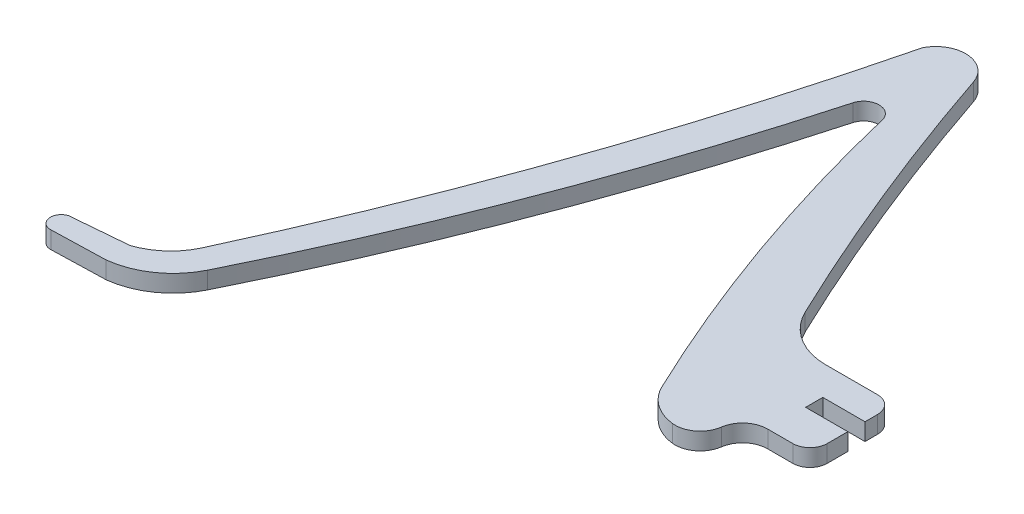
ISO-10303-21;
HEADER;
FILE_DESCRIPTION(('STEP AP214'),'2;1');
FILE_NAME('part.step','',(''),(''),'','','');
FILE_SCHEMA(('AUTOMOTIVE_DESIGN { 1 0 10303 214 1 1 1 1 }'));
ENDSEC;
DATA;
#1=APPLICATION_CONTEXT('core data for automotive mechanical design processes');
#2=APPLICATION_PROTOCOL_DEFINITION('international standard','automotive_design',2000,#1);
#3=PRODUCT_CONTEXT('',#1,'mechanical');
#4=PRODUCT('Part','Part','',(#3));
#5=PRODUCT_RELATED_PRODUCT_CATEGORY('part','',(#4));
#6=PRODUCT_DEFINITION_FORMATION('','',#4);
#7=PRODUCT_DEFINITION_CONTEXT('part definition',#1,'design');
#8=PRODUCT_DEFINITION('design','',#6,#7);
#9=PRODUCT_DEFINITION_SHAPE('','',#8);
#10=(LENGTH_UNIT() NAMED_UNIT(*) SI_UNIT(.MILLI.,.METRE.));
#11=(NAMED_UNIT(*) PLANE_ANGLE_UNIT() SI_UNIT($,.RADIAN.));
#12=(NAMED_UNIT(*) SI_UNIT($,.STERADIAN.) SOLID_ANGLE_UNIT());
#13=UNCERTAINTY_MEASURE_WITH_UNIT(LENGTH_MEASURE(1.E-05),#10,'distance_accuracy_value','');
#14=(GEOMETRIC_REPRESENTATION_CONTEXT(3) GLOBAL_UNCERTAINTY_ASSIGNED_CONTEXT((#13)) GLOBAL_UNIT_ASSIGNED_CONTEXT((#10,
#11,#12)) REPRESENTATION_CONTEXT('',''));
#15=CARTESIAN_POINT('',(0.,0.,0.));
#16=DIRECTION('',(0.,0.,1.));
#17=DIRECTION('',(1.,0.,0.));
#18=AXIS2_PLACEMENT_3D('',#15,#16,#17);
#19=CARTESIAN_POINT('',(-41735.6171870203,3.,-18306.9316403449));
#20=DIRECTION('',(0.,-1.,0.));
#21=DIRECTION('',(0.,0.,-1.));
#22=AXIS2_PLACEMENT_3D('',#19,#20,#21);
#23=CYLINDRICAL_SURFACE('',#22,1.87725100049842);
#24=CARTESIAN_POINT('',(-41735.6171870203,0.,-18306.9316403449));
#25=DIRECTION('',(0.,1.,0.));
#26=DIRECTION('',(0.,0.,1.));
#27=AXIS2_PLACEMENT_3D('',#24,#25,#26);
#28=CIRCLE('',#27,1.87725100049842);
#29=CARTESIAN_POINT('',(-41735.449746,0.,-18308.801409));
#30=VERTEX_POINT('',#29);
#31=CARTESIAN_POINT('',(-41735.564459,0.,-18305.0551299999));
#32=VERTEX_POINT('',#31);
#33=EDGE_CURVE('E228',#30,#32,#28,.T.);
#34=ORIENTED_EDGE('',*,*,#33,.T.);
#35=DIRECTION('',(0.,-1.,0.));
#36=VECTOR('',#35,1.);
#37=CARTESIAN_POINT('',(-41735.564459,3.,-18305.0551299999));
#38=LINE('',#37,#36);
#39=CARTESIAN_POINT('',(-41735.564459,3.,-18305.0551299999));
#40=VERTEX_POINT('',#39);
#41=EDGE_CURVE('E11',#40,#32,#38,.T.);
#42=ORIENTED_EDGE('',*,*,#41,.F.);
#43=CARTESIAN_POINT('',(-41735.6171870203,3.,-18306.9316403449));
#44=DIRECTION('',(0.,1.,0.));
#45=DIRECTION('',(0.,0.,1.));
#46=AXIS2_PLACEMENT_3D('',#43,#44,#45);
#47=CIRCLE('',#46,1.87725100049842);
#48=CARTESIAN_POINT('',(-41735.449746,3.,-18308.801409));
#49=VERTEX_POINT('',#48);
#50=EDGE_CURVE('E274',#49,#40,#47,.T.);
#51=ORIENTED_EDGE('',*,*,#50,.F.);
#52=DIRECTION('',(0.,-1.,0.));
#53=VECTOR('',#52,1.);
#54=CARTESIAN_POINT('',(-41735.449746,3.,-18308.801409));
#55=LINE('',#54,#53);
#56=EDGE_CURVE('E224',#49,#30,#55,.T.);
#57=ORIENTED_EDGE('',*,*,#56,.T.);
#58=EDGE_LOOP('',(#34,#42,#51,#57));
#59=FACE_BOUND('',#58,.T.);
#60=ADVANCED_FACE('F36',(#59),#23,.T.);
#61=CARTESIAN_POINT('',(-41735.564459,3.,-18305.0551299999));
#62=DIRECTION('',(-0.0283589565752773,0.,-0.999597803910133));
#63=DIRECTION('',(-0.999597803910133,0.,0.0283589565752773));
#64=AXIS2_PLACEMENT_3D('',#61,#62,#63);
#65=PLANE('',#64);
#66=DIRECTION('',(0.999597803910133,0.,-0.0283589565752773));
#67=VECTOR('',#66,1.);
#68=CARTESIAN_POINT('',(-41735.564459,0.,-18305.0551299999));
#69=LINE('',#68,#67);
#70=CARTESIAN_POINT('',(-41726.148437,0.,-18305.322266));
#71=VERTEX_POINT('',#70);
#72=EDGE_CURVE('E231',#32,#71,#69,.T.);
#73=ORIENTED_EDGE('',*,*,#72,.T.);
#74=DIRECTION('',(0.,-1.,0.));
#75=VECTOR('',#74,1.);
#76=CARTESIAN_POINT('',(-41726.148437,3.,-18305.322266));
#77=LINE('',#76,#75);
#78=CARTESIAN_POINT('',(-41726.148437,3.,-18305.322266));
#79=VERTEX_POINT('',#78);
#80=EDGE_CURVE('E44',#79,#71,#77,.T.);
#81=ORIENTED_EDGE('',*,*,#80,.F.);
#82=DIRECTION('',(0.999597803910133,0.,-0.0283589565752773));
#83=VECTOR('',#82,1.);
#84=CARTESIAN_POINT('',(-41735.564459,3.,-18305.0551299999));
#85=LINE('',#84,#83);
#86=EDGE_CURVE('E143',#40,#79,#85,.T.);
#87=ORIENTED_EDGE('',*,*,#86,.F.);
#88=ORIENTED_EDGE('',*,*,#41,.T.);
#89=EDGE_LOOP('',(#73,#81,#87,#88));
#90=FACE_BOUND('',#89,.T.);
#91=ADVANCED_FACE('F412',(#90),#65,.F.);
#92=CARTESIAN_POINT('',(-41727.6904464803,3.,-18318.5260678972));
#93=DIRECTION('',(0.,-1.,0.));
#94=DIRECTION('',(0.,0.,-1.));
#95=AXIS2_PLACEMENT_3D('',#92,#93,#94);
#96=CYLINDRICAL_SURFACE('',#95,13.2935389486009);
#97=CARTESIAN_POINT('',(-41727.6904464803,0.,-18318.5260678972));
#98=DIRECTION('',(0.,1.,0.));
#99=DIRECTION('',(0.,0.,1.));
#100=AXIS2_PLACEMENT_3D('',#97,#98,#99);
#101=CIRCLE('',#100,13.2935389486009);
#102=CARTESIAN_POINT('',(-41715.768727,0.,-18312.644675));
#103=VERTEX_POINT('',#102);
#104=EDGE_CURVE('E233',#71,#103,#101,.T.);
#105=ORIENTED_EDGE('',*,*,#104,.T.);
#106=DIRECTION('',(0.,-1.,0.));
#107=VECTOR('',#106,1.);
#108=CARTESIAN_POINT('',(-41715.768727,3.,-18312.644675));
#109=LINE('',#108,#107);
#110=CARTESIAN_POINT('',(-41715.768727,3.,-18312.644675));
#111=VERTEX_POINT('',#110);
#112=EDGE_CURVE('E329',#111,#103,#109,.T.);
#113=ORIENTED_EDGE('',*,*,#112,.F.);
#114=CARTESIAN_POINT('',(-41727.6904464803,3.,-18318.5260678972));
#115=DIRECTION('',(0.,1.,0.));
#116=DIRECTION('',(0.,0.,1.));
#117=AXIS2_PLACEMENT_3D('',#114,#115,#116);
#118=CIRCLE('',#117,13.2935389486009);
#119=EDGE_CURVE('E337',#79,#111,#118,.T.);
#120=ORIENTED_EDGE('',*,*,#119,.F.);
#121=ORIENTED_EDGE('',*,*,#80,.T.);
#122=EDGE_LOOP('',(#105,#113,#120,#121));
#123=FACE_BOUND('',#122,.T.);
#124=ADVANCED_FACE('F335',(#123),#96,.T.);
#125=CARTESIAN_POINT('',(-42128.664315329,3.,-18516.2507745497));
#126=DIRECTION('',(0.,-1.,0.));
#127=DIRECTION('',(0.,0.,-1.));
#128=AXIS2_PLACEMENT_3D('',#125,#126,#127);
#129=CYLINDRICAL_SURFACE('',#128,460.367473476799);
#130=CARTESIAN_POINT('',(-42128.664315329,0.,-18516.2507745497));
#131=DIRECTION('',(0.,1.,0.));
#132=DIRECTION('',(0.,0.,1.));
#133=AXIS2_PLACEMENT_3D('',#130,#131,#132);
#134=CIRCLE('',#133,460.367473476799);
#135=CARTESIAN_POINT('',(-41684.7597910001,0.,-18394.2385459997));
#136=VERTEX_POINT('',#135);
#137=EDGE_CURVE('E235',#103,#136,#134,.T.);
#138=ORIENTED_EDGE('',*,*,#137,.T.);
#139=DIRECTION('',(0.,-1.,0.));
#140=VECTOR('',#139,1.);
#141=CARTESIAN_POINT('',(-41684.7597910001,3.,-18394.2385459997));
#142=LINE('',#141,#140);
#143=CARTESIAN_POINT('',(-41684.7597910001,3.,-18394.2385459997));
#144=VERTEX_POINT('',#143);
#145=EDGE_CURVE('E326',#144,#136,#142,.T.);
#146=ORIENTED_EDGE('',*,*,#145,.F.);
#147=CARTESIAN_POINT('',(-42128.664315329,3.,-18516.2507745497));
#148=DIRECTION('',(0.,1.,0.));
#149=DIRECTION('',(0.,0.,1.));
#150=AXIS2_PLACEMENT_3D('',#147,#148,#149);
#151=CIRCLE('',#150,460.367473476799);
#152=EDGE_CURVE('E355',#111,#144,#151,.T.);
#153=ORIENTED_EDGE('',*,*,#152,.F.);
#154=ORIENTED_EDGE('',*,*,#112,.T.);
#155=EDGE_LOOP('',(#138,#146,#153,#154));
#156=FACE_BOUND('',#155,.T.);
#157=ADVANCED_FACE('F346',(#156),#129,.T.);
#158=CARTESIAN_POINT('',(-41682.1651776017,3.,-18393.5253188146));
#159=DIRECTION('',(0.,-1.,0.));
#160=DIRECTION('',(0.,0.,-1.));
#161=AXIS2_PLACEMENT_3D('',#158,#159,#160);
#162=CYLINDRICAL_SURFACE('',#161,2.69085705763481);
#163=CARTESIAN_POINT('',(-41682.1651776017,0.,-18393.5253188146));
#164=DIRECTION('',(0.,-1.,0.));
#165=DIRECTION('',(0.,0.,1.));
#166=AXIS2_PLACEMENT_3D('',#163,#164,#165);
#167=CIRCLE('',#166,2.69085705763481);
#168=CARTESIAN_POINT('',(-41679.684114,0.,-18394.566969));
#169=VERTEX_POINT('',#168);
#170=EDGE_CURVE('E237',#136,#169,#167,.T.);
#171=ORIENTED_EDGE('',*,*,#170,.T.);
#172=DIRECTION('',(0.,-1.,0.));
#173=VECTOR('',#172,1.);
#174=CARTESIAN_POINT('',(-41679.684114,3.,-18394.566969));
#175=LINE('',#174,#173);
#176=CARTESIAN_POINT('',(-41679.684114,3.,-18394.566969));
#177=VERTEX_POINT('',#176);
#178=EDGE_CURVE('E323',#177,#169,#175,.T.);
#179=ORIENTED_EDGE('',*,*,#178,.F.);
#180=CARTESIAN_POINT('',(-41682.1651776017,3.,-18393.5253188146));
#181=DIRECTION('',(0.,-1.,0.));
#182=DIRECTION('',(0.,0.,1.));
#183=AXIS2_PLACEMENT_3D('',#180,#181,#182);
#184=CIRCLE('',#183,2.69085705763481);
#185=EDGE_CURVE('E352',#144,#177,#184,.T.);
#186=ORIENTED_EDGE('',*,*,#185,.F.);
#187=ORIENTED_EDGE('',*,*,#145,.T.);
#188=EDGE_LOOP('',(#171,#179,#186,#187));
#189=FACE_BOUND('',#188,.T.);
#190=ADVANCED_FACE('F350',(#189),#162,.F.);
#191=CARTESIAN_POINT('',(-41387.5661853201,3.,-18464.1934135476));
#192=DIRECTION('',(0.,-1.,0.));
#193=DIRECTION('',(0.,0.,-1.));
#194=AXIS2_PLACEMENT_3D('',#191,#192,#193);
#195=CYLINDRICAL_SURFACE('',#194,300.3010590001);
#196=CARTESIAN_POINT('',(-41387.5661853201,0.,-18464.1934135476));
#197=DIRECTION('',(0.,1.,0.));
#198=DIRECTION('',(0.,0.,1.));
#199=AXIS2_PLACEMENT_3D('',#196,#197,#198);
#200=CIRCLE('',#199,300.3010590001);
#201=CARTESIAN_POINT('',(-41658.479214,0.,-18334.6293100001));
#202=VERTEX_POINT('',#201);
#203=EDGE_CURVE('E239',#169,#202,#200,.T.);
#204=ORIENTED_EDGE('',*,*,#203,.T.);
#205=DIRECTION('',(0.,-1.,0.));
#206=VECTOR('',#205,1.);
#207=CARTESIAN_POINT('',(-41658.479214,3.,-18334.6293100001));
#208=LINE('',#207,#206);
#209=CARTESIAN_POINT('',(-41658.479214,3.,-18334.6293100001));
#210=VERTEX_POINT('',#209);
#211=EDGE_CURVE('E320',#210,#202,#208,.T.);
#212=ORIENTED_EDGE('',*,*,#211,.F.);
#213=CARTESIAN_POINT('',(-41387.5661853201,3.,-18464.1934135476));
#214=DIRECTION('',(0.,1.,0.));
#215=DIRECTION('',(0.,0.,1.));
#216=AXIS2_PLACEMENT_3D('',#213,#214,#215);
#217=CIRCLE('',#216,300.3010590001);
#218=EDGE_CURVE('E354',#177,#210,#217,.T.);
#219=ORIENTED_EDGE('',*,*,#218,.F.);
#220=ORIENTED_EDGE('',*,*,#178,.T.);
#221=EDGE_LOOP('',(#204,#212,#219,#220));
#222=FACE_BOUND('',#221,.T.);
#223=ADVANCED_FACE('F425',(#222),#195,.T.);
#224=CARTESIAN_POINT('',(-41651.0954421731,3.,-18338.1613657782));
#225=DIRECTION('',(0.,-1.,0.));
#226=DIRECTION('',(0.,0.,-1.));
#227=AXIS2_PLACEMENT_3D('',#224,#225,#226);
#228=CYLINDRICAL_SURFACE('',#227,8.18507815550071);
#229=CARTESIAN_POINT('',(-41651.0954421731,0.,-18338.1613657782));
#230=DIRECTION('',(0.,1.,0.));
#231=DIRECTION('',(0.,0.,1.));
#232=AXIS2_PLACEMENT_3D('',#229,#230,#231);
#233=CIRCLE('',#232,8.18507815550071);
#234=CARTESIAN_POINT('',(-41652.048728,0.,-18330.03199));
#235=VERTEX_POINT('',#234);
#236=EDGE_CURVE('E241',#202,#235,#233,.T.);
#237=ORIENTED_EDGE('',*,*,#236,.T.);
#238=DIRECTION('',(0.,-1.,0.));
#239=VECTOR('',#238,1.);
#240=CARTESIAN_POINT('',(-41652.048728,3.,-18330.03199));
#241=LINE('',#240,#239);
#242=CARTESIAN_POINT('',(-41652.048728,3.,-18330.03199));
#243=VERTEX_POINT('',#242);
#244=EDGE_CURVE('E317',#243,#235,#241,.T.);
#245=ORIENTED_EDGE('',*,*,#244,.F.);
#246=CARTESIAN_POINT('',(-41651.0954421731,3.,-18338.1613657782));
#247=DIRECTION('',(0.,1.,0.));
#248=DIRECTION('',(0.,0.,1.));
#249=AXIS2_PLACEMENT_3D('',#246,#247,#248);
#250=CIRCLE('',#249,8.18507815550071);
#251=EDGE_CURVE('E357',#210,#243,#250,.T.);
#252=ORIENTED_EDGE('',*,*,#251,.F.);
#253=ORIENTED_EDGE('',*,*,#211,.T.);
#254=EDGE_LOOP('',(#237,#245,#252,#253));
#255=FACE_BOUND('',#254,.T.);
#256=ADVANCED_FACE('F428',(#255),#228,.T.);
#257=CARTESIAN_POINT('',(-41651.5397496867,3.,-18334.3725173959));
#258=DIRECTION('',(0.,-1.,0.));
#259=DIRECTION('',(0.,0.,-1.));
#260=AXIS2_PLACEMENT_3D('',#257,#258,#259);
#261=CYLINDRICAL_SURFACE('',#260,4.37026738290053);
#262=CARTESIAN_POINT('',(-41651.5397496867,0.,-18334.3725173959));
#263=DIRECTION('',(0.,1.,0.));
#264=DIRECTION('',(0.,0.,1.));
#265=AXIS2_PLACEMENT_3D('',#262,#263,#264);
#266=CIRCLE('',#265,4.37026738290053);
#267=CARTESIAN_POINT('',(-41647.213194,0.,-18333.755952));
#268=VERTEX_POINT('',#267);
#269=EDGE_CURVE('E243',#235,#268,#266,.T.);
#270=ORIENTED_EDGE('',*,*,#269,.T.);
#271=DIRECTION('',(0.,-1.,0.));
#272=VECTOR('',#271,1.);
#273=CARTESIAN_POINT('',(-41647.213194,3.,-18333.755952));
#274=LINE('',#273,#272);
#275=CARTESIAN_POINT('',(-41647.213194,3.,-18333.755952));
#276=VERTEX_POINT('',#275);
#277=EDGE_CURVE('E314',#276,#268,#274,.T.);
#278=ORIENTED_EDGE('',*,*,#277,.F.);
#279=CARTESIAN_POINT('',(-41651.5397496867,3.,-18334.3725173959));
#280=DIRECTION('',(0.,1.,0.));
#281=DIRECTION('',(0.,0.,1.));
#282=AXIS2_PLACEMENT_3D('',#279,#280,#281);
#283=CIRCLE('',#282,4.37026738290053);
#284=EDGE_CURVE('E363',#243,#276,#283,.T.);
#285=ORIENTED_EDGE('',*,*,#284,.F.);
#286=ORIENTED_EDGE('',*,*,#244,.T.);
#287=EDGE_LOOP('',(#270,#278,#285,#286));
#288=FACE_BOUND('',#287,.T.);
#289=ADVANCED_FACE('F432',(#288),#261,.T.);
#290=CARTESIAN_POINT('',(-41642.9001352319,3.,-18333.1391655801));
#291=DIRECTION('',(0.,-1.,0.));
#292=DIRECTION('',(0.,0.,-1.));
#293=AXIS2_PLACEMENT_3D('',#290,#291,#292);
#294=CYLINDRICAL_SURFACE('',#293,4.35693716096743);
#295=CARTESIAN_POINT('',(-41642.9001352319,0.,-18333.1391655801));
#296=DIRECTION('',(0.,-1.,0.));
#297=DIRECTION('',(0.,0.,1.));
#298=AXIS2_PLACEMENT_3D('',#295,#296,#297);
#299=CIRCLE('',#298,4.35693716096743);
#300=CARTESIAN_POINT('',(-41642.8612260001,0.,-18337.495929));
#301=VERTEX_POINT('',#300);
#302=EDGE_CURVE('E245',#268,#301,#299,.T.);
#303=ORIENTED_EDGE('',*,*,#302,.T.);
#304=DIRECTION('',(0.,-1.,0.));
#305=VECTOR('',#304,1.);
#306=CARTESIAN_POINT('',(-41642.8612260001,3.,-18337.495929));
#307=LINE('',#306,#305);
#308=CARTESIAN_POINT('',(-41642.8612260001,3.,-18337.495929));
#309=VERTEX_POINT('',#308);
#310=EDGE_CURVE('E311',#309,#301,#307,.T.);
#311=ORIENTED_EDGE('',*,*,#310,.F.);
#312=CARTESIAN_POINT('',(-41642.9001352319,3.,-18333.1391655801));
#313=DIRECTION('',(0.,-1.,0.));
#314=DIRECTION('',(0.,0.,1.));
#315=AXIS2_PLACEMENT_3D('',#312,#313,#314);
#316=CIRCLE('',#315,4.35693716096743);
#317=EDGE_CURVE('E365',#276,#309,#316,.T.);
#318=ORIENTED_EDGE('',*,*,#317,.F.);
#319=ORIENTED_EDGE('',*,*,#277,.T.);
#320=EDGE_LOOP('',(#303,#311,#318,#319));
#321=FACE_BOUND('',#320,.T.);
#322=ADVANCED_FACE('F436',(#321),#294,.F.);
#323=CARTESIAN_POINT('',(-41642.8612260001,3.,-18337.495929));
#324=DIRECTION('',(-3.7732018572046E-05,0.,-0.999999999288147));
#325=DIRECTION('',(-0.999999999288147,0.,3.7732018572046E-05));
#326=AXIS2_PLACEMENT_3D('',#323,#324,#325);
#327=PLANE('',#326);
#328=DIRECTION('',(0.999999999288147,0.,-3.7732018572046E-05));
#329=VECTOR('',#328,1.);
#330=CARTESIAN_POINT('',(-41642.8612260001,0.,-18337.495929));
#331=LINE('',#330,#329);
#332=CARTESIAN_POINT('',(-41638.488281,0.,-18337.496094));
#333=VERTEX_POINT('',#332);
#334=EDGE_CURVE('E247',#301,#333,#331,.T.);
#335=ORIENTED_EDGE('',*,*,#334,.T.);
#336=DIRECTION('',(0.,-1.,0.));
#337=VECTOR('',#336,1.);
#338=CARTESIAN_POINT('',(-41638.488281,3.,-18337.496094));
#339=LINE('',#338,#337);
#340=CARTESIAN_POINT('',(-41638.488281,3.,-18337.496094));
#341=VERTEX_POINT('',#340);
#342=EDGE_CURVE('E308',#341,#333,#339,.T.);
#343=ORIENTED_EDGE('',*,*,#342,.F.);
#344=DIRECTION('',(0.999999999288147,0.,-3.7732018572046E-05));
#345=VECTOR('',#344,1.);
#346=CARTESIAN_POINT('',(-41642.8612260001,3.,-18337.495929));
#347=LINE('',#346,#345);
#348=EDGE_CURVE('E367',#309,#341,#347,.T.);
#349=ORIENTED_EDGE('',*,*,#348,.F.);
#350=ORIENTED_EDGE('',*,*,#310,.T.);
#351=EDGE_LOOP('',(#335,#343,#349,#350));
#352=FACE_BOUND('',#351,.T.);
#353=ADVANCED_FACE('F440',(#352),#327,.F.);
#354=CARTESIAN_POINT('',(-41638.4892569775,3.,-18340.4970698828));
#355=DIRECTION('',(0.,-1.,0.));
#356=DIRECTION('',(0.,0.,-1.));
#357=AXIS2_PLACEMENT_3D('',#354,#355,#356);
#358=CYLINDRICAL_SURFACE('',#357,3.00097604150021);
#359=CARTESIAN_POINT('',(-41638.4892569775,0.,-18340.4970698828));
#360=DIRECTION('',(0.,1.,0.));
#361=DIRECTION('',(0.,0.,1.));
#362=AXIS2_PLACEMENT_3D('',#359,#360,#361);
#363=CIRCLE('',#362,3.00097604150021);
#364=CARTESIAN_POINT('',(-41635.488282,0.,-18340.499597));
#365=VERTEX_POINT('',#364);
#366=EDGE_CURVE('E249',#333,#365,#363,.T.);
#367=ORIENTED_EDGE('',*,*,#366,.T.);
#368=DIRECTION('',(0.,-1.,0.));
#369=VECTOR('',#368,1.);
#370=CARTESIAN_POINT('',(-41635.488282,3.,-18340.499597));
#371=LINE('',#370,#369);
#372=CARTESIAN_POINT('',(-41635.488282,3.,-18340.499597));
#373=VERTEX_POINT('',#372);
#374=EDGE_CURVE('E305',#373,#365,#371,.T.);
#375=ORIENTED_EDGE('',*,*,#374,.F.);
#376=CARTESIAN_POINT('',(-41638.4892569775,3.,-18340.4970698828));
#377=DIRECTION('',(0.,1.,0.));
#378=DIRECTION('',(0.,0.,1.));
#379=AXIS2_PLACEMENT_3D('',#376,#377,#378);
#380=CIRCLE('',#379,3.00097604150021);
#381=EDGE_CURVE('E369',#341,#373,#380,.T.);
#382=ORIENTED_EDGE('',*,*,#381,.F.);
#383=ORIENTED_EDGE('',*,*,#342,.T.);
#384=EDGE_LOOP('',(#367,#375,#382,#383));
#385=FACE_BOUND('',#384,.T.);
#386=ADVANCED_FACE('F444',(#385),#358,.T.);
#387=CARTESIAN_POINT('',(-41635.488282,3.,-18340.499597));
#388=DIRECTION('',(-0.999999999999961,0.,-2.78240565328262E-07));
#389=DIRECTION('',(-2.78240565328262E-07,0.,0.999999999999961));
#390=AXIS2_PLACEMENT_3D('',#387,#388,#389);
#391=PLANE('',#390);
#392=DIRECTION('',(2.78240565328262E-07,0.,-0.999999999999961));
#393=VECTOR('',#392,1.);
#394=CARTESIAN_POINT('',(-41635.488282,0.,-18340.499597));
#395=LINE('',#394,#393);
#396=CARTESIAN_POINT('',(-41635.488281,0.,-18344.09375));
#397=VERTEX_POINT('',#396);
#398=EDGE_CURVE('E251',#365,#397,#395,.T.);
#399=ORIENTED_EDGE('',*,*,#398,.T.);
#400=DIRECTION('',(0.,-1.,0.));
#401=VECTOR('',#400,1.);
#402=CARTESIAN_POINT('',(-41635.488281,3.,-18344.09375));
#403=LINE('',#402,#401);
#404=CARTESIAN_POINT('',(-41635.488281,3.,-18344.09375));
#405=VERTEX_POINT('',#404);
#406=EDGE_CURVE('E302',#405,#397,#403,.T.);
#407=ORIENTED_EDGE('',*,*,#406,.F.);
#408=DIRECTION('',(2.78240565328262E-07,0.,-0.999999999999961));
#409=VECTOR('',#408,1.);
#410=CARTESIAN_POINT('',(-41635.488282,3.,-18340.499597));
#411=LINE('',#410,#409);
#412=EDGE_CURVE('E371',#373,#405,#411,.T.);
#413=ORIENTED_EDGE('',*,*,#412,.F.);
#414=ORIENTED_EDGE('',*,*,#374,.T.);
#415=EDGE_LOOP('',(#399,#407,#413,#414));
#416=FACE_BOUND('',#415,.T.);
#417=ADVANCED_FACE('F448',(#416),#391,.F.);
#418=CARTESIAN_POINT('',(-41635.488281,3.,-18344.09375));
#419=DIRECTION('',(0.,0.,1.));
#420=DIRECTION('',(1.,0.,0.));
#421=AXIS2_PLACEMENT_3D('',#418,#419,#420);
#422=PLANE('',#421);
#423=DIRECTION('',(-1.,0.,0.));
#424=VECTOR('',#423,1.);
#425=CARTESIAN_POINT('',(-41635.488281,0.,-18344.09375));
#426=LINE('',#425,#424);
#427=CARTESIAN_POINT('',(-41642.851562,0.,-18344.09375));
#428=VERTEX_POINT('',#427);
#429=EDGE_CURVE('E253',#397,#428,#426,.T.);
#430=ORIENTED_EDGE('',*,*,#429,.T.);
#431=DIRECTION('',(0.,-1.,0.));
#432=VECTOR('',#431,1.);
#433=CARTESIAN_POINT('',(-41642.851562,3.,-18344.09375));
#434=LINE('',#433,#432);
#435=CARTESIAN_POINT('',(-41642.851562,3.,-18344.09375));
#436=VERTEX_POINT('',#435);
#437=EDGE_CURVE('E299',#436,#428,#434,.T.);
#438=ORIENTED_EDGE('',*,*,#437,.F.);
#439=DIRECTION('',(-1.,0.,0.));
#440=VECTOR('',#439,1.);
#441=CARTESIAN_POINT('',(-41635.488281,3.,-18344.09375));
#442=LINE('',#441,#440);
#443=EDGE_CURVE('E373',#405,#436,#442,.T.);
#444=ORIENTED_EDGE('',*,*,#443,.F.);
#445=ORIENTED_EDGE('',*,*,#406,.T.);
#446=EDGE_LOOP('',(#430,#438,#444,#445));
#447=FACE_BOUND('',#446,.T.);
#448=ADVANCED_FACE('F452',(#447),#422,.F.);
#449=CARTESIAN_POINT('',(-41642.851562,3.,-18344.09375));
#450=DIRECTION('',(-0.999999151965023,0.,0.00130233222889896));
#451=DIRECTION('',(0.00130233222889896,0.,0.999999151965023));
#452=AXIS2_PLACEMENT_3D('',#449,#450,#451);
#453=PLANE('',#452);
#454=DIRECTION('',(-0.00130233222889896,0.,-0.999999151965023));
#455=VECTOR('',#454,1.);
#456=CARTESIAN_POINT('',(-41642.851562,0.,-18344.09375));
#457=LINE('',#456,#455);
#458=CARTESIAN_POINT('',(-41642.855469,0.,-18347.09375));
#459=VERTEX_POINT('',#458);
#460=EDGE_CURVE('E255',#428,#459,#457,.T.);
#461=ORIENTED_EDGE('',*,*,#460,.T.);
#462=DIRECTION('',(0.,-1.,0.));
#463=VECTOR('',#462,1.);
#464=CARTESIAN_POINT('',(-41642.855469,3.,-18347.09375));
#465=LINE('',#464,#463);
#466=CARTESIAN_POINT('',(-41642.855469,3.,-18347.09375));
#467=VERTEX_POINT('',#466);
#468=EDGE_CURVE('E296',#467,#459,#465,.T.);
#469=ORIENTED_EDGE('',*,*,#468,.F.);
#470=DIRECTION('',(-0.00130233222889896,0.,-0.999999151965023));
#471=VECTOR('',#470,1.);
#472=CARTESIAN_POINT('',(-41642.851562,3.,-18344.09375));
#473=LINE('',#472,#471);
#474=EDGE_CURVE('E375',#436,#467,#473,.T.);
#475=ORIENTED_EDGE('',*,*,#474,.F.);
#476=ORIENTED_EDGE('',*,*,#437,.T.);
#477=EDGE_LOOP('',(#461,#469,#475,#476));
#478=FACE_BOUND('',#477,.T.);
#479=ADVANCED_FACE('F456',(#478),#453,.F.);
#480=CARTESIAN_POINT('',(-41642.855469,3.,-18347.09375));
#481=DIRECTION('',(0.,0.,-1.));
#482=DIRECTION('',(-1.,0.,0.));
#483=AXIS2_PLACEMENT_3D('',#480,#481,#482);
#484=PLANE('',#483);
#485=DIRECTION('',(1.,0.,0.));
#486=VECTOR('',#485,1.);
#487=CARTESIAN_POINT('',(-41642.855469,0.,-18347.09375));
#488=LINE('',#487,#486);
#489=CARTESIAN_POINT('',(-41635.492187,0.,-18347.09375));
#490=VERTEX_POINT('',#489);
#491=EDGE_CURVE('E257',#459,#490,#488,.T.);
#492=ORIENTED_EDGE('',*,*,#491,.T.);
#493=DIRECTION('',(0.,-1.,0.));
#494=VECTOR('',#493,1.);
#495=CARTESIAN_POINT('',(-41635.492187,3.,-18347.09375));
#496=LINE('',#495,#494);
#497=CARTESIAN_POINT('',(-41635.492187,3.,-18347.09375));
#498=VERTEX_POINT('',#497);
#499=EDGE_CURVE('E293',#498,#490,#496,.T.);
#500=ORIENTED_EDGE('',*,*,#499,.F.);
#501=DIRECTION('',(1.,0.,0.));
#502=VECTOR('',#501,1.);
#503=CARTESIAN_POINT('',(-41642.855469,3.,-18347.09375));
#504=LINE('',#503,#502);
#505=EDGE_CURVE('E377',#467,#498,#504,.T.);
#506=ORIENTED_EDGE('',*,*,#505,.F.);
#507=ORIENTED_EDGE('',*,*,#468,.T.);
#508=EDGE_LOOP('',(#492,#500,#506,#507));
#509=FACE_BOUND('',#508,.T.);
#510=ADVANCED_FACE('F460',(#509),#484,.F.);
#511=CARTESIAN_POINT('',(-41635.492187,3.,-18347.09375));
#512=DIRECTION('',(-0.999998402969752,0.,-0.00178719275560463));
#513=DIRECTION('',(-0.00178719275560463,0.,0.999998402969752));
#514=AXIS2_PLACEMENT_3D('',#511,#512,#513);
#515=PLANE('',#514);
#516=DIRECTION('',(0.00178719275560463,0.,-0.999998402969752));
#517=VECTOR('',#516,1.);
#518=CARTESIAN_POINT('',(-41635.492187,0.,-18347.09375));
#519=LINE('',#518,#517);
#520=CARTESIAN_POINT('',(-41635.488281,0.,-18349.279297));
#521=VERTEX_POINT('',#520);
#522=EDGE_CURVE('E259',#490,#521,#519,.T.);
#523=ORIENTED_EDGE('',*,*,#522,.T.);
#524=DIRECTION('',(0.,-1.,0.));
#525=VECTOR('',#524,1.);
#526=CARTESIAN_POINT('',(-41635.488281,3.,-18349.279297));
#527=LINE('',#526,#525);
#528=CARTESIAN_POINT('',(-41635.488281,3.,-18349.279297));
#529=VERTEX_POINT('',#528);
#530=EDGE_CURVE('E290',#529,#521,#527,.T.);
#531=ORIENTED_EDGE('',*,*,#530,.F.);
#532=DIRECTION('',(0.00178719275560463,0.,-0.999998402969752));
#533=VECTOR('',#532,1.);
#534=CARTESIAN_POINT('',(-41635.492187,3.,-18347.09375));
#535=LINE('',#534,#533);
#536=EDGE_CURVE('E379',#498,#529,#535,.T.);
#537=ORIENTED_EDGE('',*,*,#536,.F.);
#538=ORIENTED_EDGE('',*,*,#499,.T.);
#539=EDGE_LOOP('',(#523,#531,#537,#538));
#540=FACE_BOUND('',#539,.T.);
#541=ADVANCED_FACE('F464',(#540),#515,.F.);
#542=CARTESIAN_POINT('',(-41638.4902327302,3.,-18349.2773452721));
#543=DIRECTION('',(0.,-1.,0.));
#544=DIRECTION('',(0.,0.,-1.));
#545=AXIS2_PLACEMENT_3D('',#542,#543,#544);
#546=CYLINDRICAL_SURFACE('',#545,3.001952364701);
#547=CARTESIAN_POINT('',(-41638.4902327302,0.,-18349.2773452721));
#548=DIRECTION('',(0.,1.,0.));
#549=DIRECTION('',(0.,0.,1.));
#550=AXIS2_PLACEMENT_3D('',#547,#548,#549);
#551=CIRCLE('',#550,3.001952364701);
#552=CARTESIAN_POINT('',(-41638.492188,0.,-18352.279297));
#553=VERTEX_POINT('',#552);
#554=EDGE_CURVE('E261',#521,#553,#551,.T.);
#555=ORIENTED_EDGE('',*,*,#554,.T.);
#556=DIRECTION('',(0.,-1.,0.));
#557=VECTOR('',#556,1.);
#558=CARTESIAN_POINT('',(-41638.492188,3.,-18352.279297));
#559=LINE('',#558,#557);
#560=CARTESIAN_POINT('',(-41638.492188,3.,-18352.279297));
#561=VERTEX_POINT('',#560);
#562=EDGE_CURVE('E287',#561,#553,#559,.T.);
#563=ORIENTED_EDGE('',*,*,#562,.F.);
#564=CARTESIAN_POINT('',(-41638.4902327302,3.,-18349.2773452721));
#565=DIRECTION('',(0.,1.,0.));
#566=DIRECTION('',(0.,0.,1.));
#567=AXIS2_PLACEMENT_3D('',#564,#565,#566);
#568=CIRCLE('',#567,3.001952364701);
#569=EDGE_CURVE('E381',#529,#561,#568,.T.);
#570=ORIENTED_EDGE('',*,*,#569,.F.);
#571=ORIENTED_EDGE('',*,*,#530,.T.);
#572=EDGE_LOOP('',(#555,#563,#570,#571));
#573=FACE_BOUND('',#572,.T.);
#574=ADVANCED_FACE('F468',(#573),#546,.T.);
#575=CARTESIAN_POINT('',(-41638.492188,3.,-18352.279297));
#576=DIRECTION('',(0.000209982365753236,0.,0.999999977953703));
#577=DIRECTION('',(0.999999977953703,0.,-0.000209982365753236));
#578=AXIS2_PLACEMENT_3D('',#575,#576,#577);
#579=PLANE('',#578);
#580=DIRECTION('',(-0.999999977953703,0.,0.000209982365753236));
#581=VECTOR('',#580,1.);
#582=CARTESIAN_POINT('',(-41638.492188,0.,-18352.279297));
#583=LINE('',#582,#581);
#584=CARTESIAN_POINT('',(-41647.792969,0.,-18352.277344));
#585=VERTEX_POINT('',#584);
#586=EDGE_CURVE('E263',#553,#585,#583,.T.);
#587=ORIENTED_EDGE('',*,*,#586,.T.);
#588=DIRECTION('',(0.,-1.,0.));
#589=VECTOR('',#588,1.);
#590=CARTESIAN_POINT('',(-41647.792969,3.,-18352.277344));
#591=LINE('',#590,#589);
#592=CARTESIAN_POINT('',(-41647.792969,3.,-18352.277344));
#593=VERTEX_POINT('',#592);
#594=EDGE_CURVE('E284',#593,#585,#591,.T.);
#595=ORIENTED_EDGE('',*,*,#594,.F.);
#596=DIRECTION('',(-0.999999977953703,0.,0.000209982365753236));
#597=VECTOR('',#596,1.);
#598=CARTESIAN_POINT('',(-41638.492188,3.,-18352.279297));
#599=LINE('',#598,#597);
#600=EDGE_CURVE('E383',#561,#593,#599,.T.);
#601=ORIENTED_EDGE('',*,*,#600,.F.);
#602=ORIENTED_EDGE('',*,*,#562,.T.);
#603=EDGE_LOOP('',(#587,#595,#601,#602));
#604=FACE_BOUND('',#603,.T.);
#605=ADVANCED_FACE('F472',(#604),#579,.F.);
#606=CARTESIAN_POINT('',(-41647.4903107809,3.,-18363.1296391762));
#607=DIRECTION('',(0.,-1.,0.));
#608=DIRECTION('',(0.,0.,-1.));
#609=AXIS2_PLACEMENT_3D('',#606,#607,#608);
#610=CYLINDRICAL_SURFACE('',#609,10.8565147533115);
#611=CARTESIAN_POINT('',(-41647.4903107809,0.,-18363.1296391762));
#612=DIRECTION('',(0.,-1.,0.));
#613=DIRECTION('',(0.,0.,1.));
#614=AXIS2_PLACEMENT_3D('',#611,#612,#613);
#615=CIRCLE('',#614,10.8565147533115);
#616=CARTESIAN_POINT('',(-41657.286164,0.,-18358.4493429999));
#617=VERTEX_POINT('',#616);
#618=EDGE_CURVE('E265',#585,#617,#615,.T.);
#619=ORIENTED_EDGE('',*,*,#618,.T.);
#620=DIRECTION('',(0.,-1.,0.));
#621=VECTOR('',#620,1.);
#622=CARTESIAN_POINT('',(-41657.286164,3.,-18358.4493429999));
#623=LINE('',#622,#621);
#624=CARTESIAN_POINT('',(-41657.286164,3.,-18358.4493429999));
#625=VERTEX_POINT('',#624);
#626=EDGE_CURVE('E281',#625,#617,#623,.T.);
#627=ORIENTED_EDGE('',*,*,#626,.F.);
#628=CARTESIAN_POINT('',(-41647.4903107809,3.,-18363.1296391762));
#629=DIRECTION('',(0.,-1.,0.));
#630=DIRECTION('',(0.,0.,1.));
#631=AXIS2_PLACEMENT_3D('',#628,#629,#630);
#632=CIRCLE('',#631,10.8565147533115);
#633=EDGE_CURVE('E385',#593,#625,#632,.T.);
#634=ORIENTED_EDGE('',*,*,#633,.F.);
#635=ORIENTED_EDGE('',*,*,#594,.T.);
#636=EDGE_LOOP('',(#619,#627,#634,#635));
#637=FACE_BOUND('',#636,.T.);
#638=ADVANCED_FACE('F476',(#637),#610,.F.);
#639=CARTESIAN_POINT('',(-41255.6259313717,3.,-18550.4555683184));
#640=DIRECTION('',(0.,-1.,0.));
#641=DIRECTION('',(0.,0.,-1.));
#642=AXIS2_PLACEMENT_3D('',#639,#640,#641);
#643=CYLINDRICAL_SURFACE('',#642,445.193590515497);
#644=CARTESIAN_POINT('',(-41255.6259313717,0.,-18550.4555683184));
#645=DIRECTION('',(0.,-1.,0.));
#646=DIRECTION('',(0.,0.,1.));
#647=AXIS2_PLACEMENT_3D('',#644,#645,#646);
#648=CIRCLE('',#647,445.193590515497);
#649=CARTESIAN_POINT('',(-41677.4004830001,0.,-18407.9650050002));
#650=VERTEX_POINT('',#649);
#651=EDGE_CURVE('E267',#617,#650,#648,.T.);
#652=ORIENTED_EDGE('',*,*,#651,.T.);
#653=DIRECTION('',(0.,-1.,0.));
#654=VECTOR('',#653,1.);
#655=CARTESIAN_POINT('',(-41677.4004830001,3.,-18407.9650050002));
#656=LINE('',#655,#654);
#657=CARTESIAN_POINT('',(-41677.4004830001,3.,-18407.9650050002));
#658=VERTEX_POINT('',#657);
#659=EDGE_CURVE('E278',#658,#650,#656,.T.);
#660=ORIENTED_EDGE('',*,*,#659,.F.);
#661=CARTESIAN_POINT('',(-41255.6259313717,3.,-18550.4555683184));
#662=DIRECTION('',(0.,-1.,0.));
#663=DIRECTION('',(0.,0.,1.));
#664=AXIS2_PLACEMENT_3D('',#661,#662,#663);
#665=CIRCLE('',#664,445.193590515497);
#666=EDGE_CURVE('E387',#625,#658,#665,.T.);
#667=ORIENTED_EDGE('',*,*,#666,.F.);
#668=ORIENTED_EDGE('',*,*,#626,.T.);
#669=EDGE_LOOP('',(#652,#660,#667,#668));
#670=FACE_BOUND('',#669,.T.);
#671=ADVANCED_FACE('F393',(#670),#643,.F.);
#672=CARTESIAN_POINT('',(-41682.34689267,3.,-18406.292911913));
#673=DIRECTION('',(0.,-1.,0.));
#674=DIRECTION('',(0.,0.,-1.));
#675=AXIS2_PLACEMENT_3D('',#672,#673,#674);
#676=CYLINDRICAL_SURFACE('',#675,5.22138524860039);
#677=CARTESIAN_POINT('',(-41682.34689267,0.,-18406.292911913));
#678=DIRECTION('',(0.,1.,0.));
#679=DIRECTION('',(0.,0.,1.));
#680=AXIS2_PLACEMENT_3D('',#677,#678,#679);
#681=CIRCLE('',#680,5.22138524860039);
#682=CARTESIAN_POINT('',(-41686.989569,0.,-18408.682142));
#683=VERTEX_POINT('',#682);
#684=EDGE_CURVE('E269',#650,#683,#681,.T.);
#685=ORIENTED_EDGE('',*,*,#684,.T.);
#686=DIRECTION('',(0.,-1.,0.));
#687=VECTOR('',#686,1.);
#688=CARTESIAN_POINT('',(-41686.989569,3.,-18408.682142));
#689=LINE('',#688,#687);
#690=CARTESIAN_POINT('',(-41686.989569,3.,-18408.682142));
#691=VERTEX_POINT('',#690);
#692=EDGE_CURVE('E219',#691,#683,#689,.T.);
#693=ORIENTED_EDGE('',*,*,#692,.F.);
#694=CARTESIAN_POINT('',(-41682.34689267,3.,-18406.292911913));
#695=DIRECTION('',(0.,1.,0.));
#696=DIRECTION('',(0.,0.,1.));
#697=AXIS2_PLACEMENT_3D('',#694,#695,#696);
#698=CIRCLE('',#697,5.22138524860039);
#699=EDGE_CURVE('E210',#658,#691,#698,.T.);
#700=ORIENTED_EDGE('',*,*,#699,.F.);
#701=ORIENTED_EDGE('',*,*,#659,.T.);
#702=EDGE_LOOP('',(#685,#693,#700,#701));
#703=FACE_BOUND('',#702,.T.);
#704=ADVANCED_FACE('F397',(#703),#676,.T.);
#705=CARTESIAN_POINT('',(-42188.2874309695,3.,-18531.9759303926));
#706=DIRECTION('',(0.,-1.,0.));
#707=DIRECTION('',(0.,0.,-1.));
#708=AXIS2_PLACEMENT_3D('',#705,#706,#707);
#709=CYLINDRICAL_SURFACE('',#708,516.237256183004);
#710=CARTESIAN_POINT('',(-42188.2874309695,0.,-18531.9759303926));
#711=DIRECTION('',(0.,-1.,0.));
#712=DIRECTION('',(0.,0.,1.));
#713=AXIS2_PLACEMENT_3D('',#710,#711,#712);
#714=CIRCLE('',#713,516.237256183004);
#715=CARTESIAN_POINT('',(-41719.689865,0.,-18315.372085));
#716=VERTEX_POINT('',#715);
#717=EDGE_CURVE('E218',#683,#716,#714,.T.);
#718=ORIENTED_EDGE('',*,*,#717,.T.);
#719=DIRECTION('',(0.,-1.,0.));
#720=VECTOR('',#719,1.);
#721=CARTESIAN_POINT('',(-41719.689865,3.,-18315.372085));
#722=LINE('',#721,#720);
#723=CARTESIAN_POINT('',(-41719.689865,3.,-18315.372085));
#724=VERTEX_POINT('',#723);
#725=EDGE_CURVE('E215',#724,#716,#722,.T.);
#726=ORIENTED_EDGE('',*,*,#725,.F.);
#727=CARTESIAN_POINT('',(-42188.2874309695,3.,-18531.9759303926));
#728=DIRECTION('',(0.,-1.,0.));
#729=DIRECTION('',(0.,0.,1.));
#730=AXIS2_PLACEMENT_3D('',#727,#728,#729);
#731=CIRCLE('',#730,516.237256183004);
#732=EDGE_CURVE('E204',#691,#724,#731,.T.);
#733=ORIENTED_EDGE('',*,*,#732,.F.);
#734=ORIENTED_EDGE('',*,*,#692,.T.);
#735=EDGE_LOOP('',(#718,#726,#733,#734));
#736=FACE_BOUND('',#735,.T.);
#737=ADVANCED_FACE('F216',(#736),#709,.F.);
#738=CARTESIAN_POINT('',(-41729.7960243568,3.,-18320.2541700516));
#739=DIRECTION('',(0.,-1.,0.));
#740=DIRECTION('',(0.,0.,-1.));
#741=AXIS2_PLACEMENT_3D('',#738,#739,#740);
#742=CYLINDRICAL_SURFACE('',#741,11.2236006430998);
#743=CARTESIAN_POINT('',(-41729.7960243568,0.,-18320.2541700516));
#744=DIRECTION('',(0.,-1.,0.));
#745=DIRECTION('',(0.,0.,1.));
#746=AXIS2_PLACEMENT_3D('',#743,#744,#745);
#747=CIRCLE('',#746,11.2236006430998);
#748=CARTESIAN_POINT('',(-41726.278402,0.,-18309.596049));
#749=VERTEX_POINT('',#748);
#750=EDGE_CURVE('E129',#716,#749,#747,.T.);
#751=ORIENTED_EDGE('',*,*,#750,.T.);
#752=DIRECTION('',(0.,-1.,0.));
#753=VECTOR('',#752,1.);
#754=CARTESIAN_POINT('',(-41726.278402,3.,-18309.596049));
#755=LINE('',#754,#753);
#756=CARTESIAN_POINT('',(-41726.278402,3.,-18309.596049));
#757=VERTEX_POINT('',#756);
#758=EDGE_CURVE('E220',#757,#749,#755,.T.);
#759=ORIENTED_EDGE('',*,*,#758,.F.);
#760=CARTESIAN_POINT('',(-41729.7960243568,3.,-18320.2541700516));
#761=DIRECTION('',(0.,-1.,0.));
#762=DIRECTION('',(0.,0.,1.));
#763=AXIS2_PLACEMENT_3D('',#760,#761,#762);
#764=CIRCLE('',#763,11.2236006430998);
#765=EDGE_CURVE('E208',#724,#757,#764,.T.);
#766=ORIENTED_EDGE('',*,*,#765,.F.);
#767=ORIENTED_EDGE('',*,*,#725,.T.);
#768=EDGE_LOOP('',(#751,#759,#766,#767));
#769=FACE_BOUND('',#768,.T.);
#770=ADVANCED_FACE('F222',(#769),#742,.F.);
#771=CARTESIAN_POINT('',(-41726.278402,3.,-18309.596049));
#772=DIRECTION('',(0.0863203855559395,0.,0.996267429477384));
#773=DIRECTION('',(0.996267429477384,0.,-0.0863203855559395));
#774=AXIS2_PLACEMENT_3D('',#771,#772,#773);
#775=PLANE('',#774);
#776=DIRECTION('',(-0.996267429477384,0.,0.0863203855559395));
#777=VECTOR('',#776,1.);
#778=CARTESIAN_POINT('',(-41726.278402,0.,-18309.596049));
#779=LINE('',#778,#777);
#780=EDGE_CURVE('E135',#749,#30,#779,.T.);
#781=ORIENTED_EDGE('',*,*,#780,.T.);
#782=ORIENTED_EDGE('',*,*,#56,.F.);
#783=DIRECTION('',(-0.996267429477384,0.,0.0863203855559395));
#784=VECTOR('',#783,1.);
#785=CARTESIAN_POINT('',(-41726.278402,3.,-18309.596049));
#786=LINE('',#785,#784);
#787=EDGE_CURVE('E52',#757,#49,#786,.T.);
#788=ORIENTED_EDGE('',*,*,#787,.F.);
#789=ORIENTED_EDGE('',*,*,#758,.T.);
#790=EDGE_LOOP('',(#781,#782,#788,#789));
#791=FACE_BOUND('',#790,.T.);
#792=ADVANCED_FACE('F401',(#791),#775,.F.);
#793=CARTESIAN_POINT('',(-41735.6171870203,3.,-18306.9316403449));
#794=DIRECTION('',(0.,1.,0.));
#795=DIRECTION('',(0.,0.,1.));
#796=AXIS2_PLACEMENT_3D('',#793,#794,#795);
#797=PLANE('',#796);
#798=ORIENTED_EDGE('',*,*,#50,.T.);
#799=ORIENTED_EDGE('',*,*,#86,.T.);
#800=ORIENTED_EDGE('',*,*,#119,.T.);
#801=ORIENTED_EDGE('',*,*,#152,.T.);
#802=ORIENTED_EDGE('',*,*,#185,.T.);
#803=ORIENTED_EDGE('',*,*,#218,.T.);
#804=ORIENTED_EDGE('',*,*,#251,.T.);
#805=ORIENTED_EDGE('',*,*,#284,.T.);
#806=ORIENTED_EDGE('',*,*,#317,.T.);
#807=ORIENTED_EDGE('',*,*,#348,.T.);
#808=ORIENTED_EDGE('',*,*,#381,.T.);
#809=ORIENTED_EDGE('',*,*,#412,.T.);
#810=ORIENTED_EDGE('',*,*,#443,.T.);
#811=ORIENTED_EDGE('',*,*,#474,.T.);
#812=ORIENTED_EDGE('',*,*,#505,.T.);
#813=ORIENTED_EDGE('',*,*,#536,.T.);
#814=ORIENTED_EDGE('',*,*,#569,.T.);
#815=ORIENTED_EDGE('',*,*,#600,.T.);
#816=ORIENTED_EDGE('',*,*,#633,.T.);
#817=ORIENTED_EDGE('',*,*,#666,.T.);
#818=ORIENTED_EDGE('',*,*,#699,.T.);
#819=ORIENTED_EDGE('',*,*,#732,.T.);
#820=ORIENTED_EDGE('',*,*,#765,.T.);
#821=ORIENTED_EDGE('',*,*,#787,.T.);
#822=EDGE_LOOP('',(#798,#799,#800,#801,#802,#803,#804,#805,#806,#807,#808,#809,#810,#811,#812,
#813,#814,#815,#816,#817,#818,#819,#820,#821));
#823=FACE_BOUND('',#822,.T.);
#824=ADVANCED_FACE('F206',(#823),#797,.T.);
#825=CARTESIAN_POINT('',(-41735.6171870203,0.,-18306.9316403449));
#826=DIRECTION('',(0.,1.,0.));
#827=DIRECTION('',(0.,0.,1.));
#828=AXIS2_PLACEMENT_3D('',#825,#826,#827);
#829=PLANE('',#828);
#830=ORIENTED_EDGE('',*,*,#33,.F.);
#831=ORIENTED_EDGE('',*,*,#780,.F.);
#832=ORIENTED_EDGE('',*,*,#750,.F.);
#833=ORIENTED_EDGE('',*,*,#717,.F.);
#834=ORIENTED_EDGE('',*,*,#684,.F.);
#835=ORIENTED_EDGE('',*,*,#651,.F.);
#836=ORIENTED_EDGE('',*,*,#618,.F.);
#837=ORIENTED_EDGE('',*,*,#586,.F.);
#838=ORIENTED_EDGE('',*,*,#554,.F.);
#839=ORIENTED_EDGE('',*,*,#522,.F.);
#840=ORIENTED_EDGE('',*,*,#491,.F.);
#841=ORIENTED_EDGE('',*,*,#460,.F.);
#842=ORIENTED_EDGE('',*,*,#429,.F.);
#843=ORIENTED_EDGE('',*,*,#398,.F.);
#844=ORIENTED_EDGE('',*,*,#366,.F.);
#845=ORIENTED_EDGE('',*,*,#334,.F.);
#846=ORIENTED_EDGE('',*,*,#302,.F.);
#847=ORIENTED_EDGE('',*,*,#269,.F.);
#848=ORIENTED_EDGE('',*,*,#236,.F.);
#849=ORIENTED_EDGE('',*,*,#203,.F.);
#850=ORIENTED_EDGE('',*,*,#170,.F.);
#851=ORIENTED_EDGE('',*,*,#137,.F.);
#852=ORIENTED_EDGE('',*,*,#104,.F.);
#853=ORIENTED_EDGE('',*,*,#72,.F.);
#854=EDGE_LOOP('',(#830,#831,#832,#833,#834,#835,#836,#837,#838,#839,#840,#841,#842,#843,#844,
#845,#846,#847,#848,#849,#850,#851,#852,#853));
#855=FACE_BOUND('',#854,.T.);
#856=ADVANCED_FACE('F341',(#855),#829,.F.);
#857=CLOSED_SHELL('',(#60,#91,#124,#157,#190,#223,#256,#289,#322,#353,#386,#417,#448,#479,#510,
#541,#574,#605,#638,#671,#704,#737,#770,#792,#824,#856));
#858=MANIFOLD_SOLID_BREP('B2',#857);
#859=ADVANCED_BREP_SHAPE_REPRESENTATION('',(#18,#858),#14);
#860=SHAPE_DEFINITION_REPRESENTATION(#9,#859);
ENDSEC;
END-ISO-10303-21;
